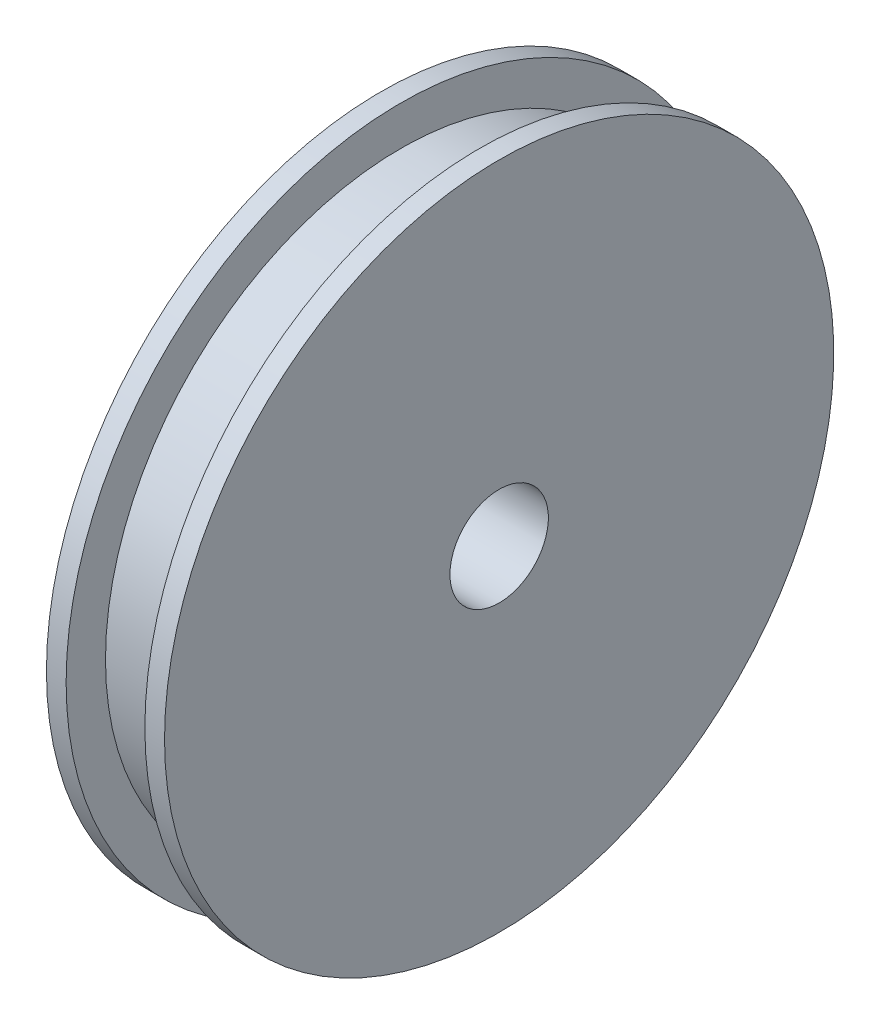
ISO-10303-21;
HEADER;
FILE_DESCRIPTION(('STEP AP214'),'2;1');
FILE_NAME('part.step','',(''),(''),'','','');
FILE_SCHEMA(('AUTOMOTIVE_DESIGN { 1 0 10303 214 1 1 1 1 }'));
ENDSEC;
DATA;
#1=APPLICATION_CONTEXT('core data for automotive mechanical design processes');
#2=APPLICATION_PROTOCOL_DEFINITION('international standard','automotive_design',2000,#1);
#3=PRODUCT_CONTEXT('',#1,'mechanical');
#4=PRODUCT('Part','Part','',(#3));
#5=PRODUCT_RELATED_PRODUCT_CATEGORY('part','',(#4));
#6=PRODUCT_DEFINITION_FORMATION('','',#4);
#7=PRODUCT_DEFINITION_CONTEXT('part definition',#1,'design');
#8=PRODUCT_DEFINITION('design','',#6,#7);
#9=PRODUCT_DEFINITION_SHAPE('','',#8);
#10=(LENGTH_UNIT() NAMED_UNIT(*) SI_UNIT(.MILLI.,.METRE.));
#11=(NAMED_UNIT(*) PLANE_ANGLE_UNIT() SI_UNIT($,.RADIAN.));
#12=(NAMED_UNIT(*) SI_UNIT($,.STERADIAN.) SOLID_ANGLE_UNIT());
#13=UNCERTAINTY_MEASURE_WITH_UNIT(LENGTH_MEASURE(1.E-05),#10,'distance_accuracy_value','');
#14=(GEOMETRIC_REPRESENTATION_CONTEXT(3) GLOBAL_UNCERTAINTY_ASSIGNED_CONTEXT((#13)) GLOBAL_UNIT_ASSIGNED_CONTEXT((#10,
#11,#12)) REPRESENTATION_CONTEXT('',''));
#15=CARTESIAN_POINT('',(0.,0.,0.));
#16=DIRECTION('',(0.,0.,1.));
#17=DIRECTION('',(1.,0.,0.));
#18=AXIS2_PLACEMENT_3D('',#15,#16,#17);
#19=CARTESIAN_POINT('',(3.,0.,0.));
#20=DIRECTION('',(-1.,0.,0.));
#21=DIRECTION('',(0.,0.,1.));
#22=AXIS2_PLACEMENT_3D('',#19,#20,#21);
#23=CYLINDRICAL_SURFACE('',#22,2.5);
#24=CARTESIAN_POINT('',(3.,0.,0.));
#25=DIRECTION('',(-1.,0.,0.));
#26=DIRECTION('',(0.,0.,1.));
#27=AXIS2_PLACEMENT_3D('',#24,#25,#26);
#28=CIRCLE('',#27,2.5);
#29=CARTESIAN_POINT('',(3.,0.,2.5));
#30=VERTEX_POINT('',#29);
#31=EDGE_CURVE('E67',#30,#30,#28,.T.);
#32=ORIENTED_EDGE('',*,*,#31,.F.);
#33=EDGE_LOOP('',(#32));
#34=FACE_BOUND('',#33,.T.);
#35=CARTESIAN_POINT('',(-2.,0.,0.));
#36=DIRECTION('',(-1.,0.,0.));
#37=DIRECTION('',(0.,0.,1.));
#38=AXIS2_PLACEMENT_3D('',#35,#36,#37);
#39=CIRCLE('',#38,2.5);
#40=CARTESIAN_POINT('',(-2.,0.,2.5));
#41=VERTEX_POINT('',#40);
#42=EDGE_CURVE('E10',#41,#41,#39,.F.);
#43=ORIENTED_EDGE('',*,*,#42,.F.);
#44=EDGE_LOOP('',(#43));
#45=FACE_BOUND('',#44,.T.);
#46=ADVANCED_FACE('F32',(#34,#45),#23,.F.);
#47=CARTESIAN_POINT('',(-3.,0.,0.));
#48=DIRECTION('',(1.,0.,0.));
#49=DIRECTION('',(0.,0.,-1.));
#50=AXIS2_PLACEMENT_3D('',#47,#48,#49);
#51=PLANE('',#50);
#52=CARTESIAN_POINT('',(-3.,0.,0.));
#53=DIRECTION('',(-1.,0.,0.));
#54=DIRECTION('',(0.,0.,1.));
#55=AXIS2_PLACEMENT_3D('',#52,#53,#54);
#56=CIRCLE('',#55,17.);
#57=CARTESIAN_POINT('',(-3.,0.,17.));
#58=VERTEX_POINT('',#57);
#59=EDGE_CURVE('E53',#58,#58,#56,.T.);
#60=ORIENTED_EDGE('',*,*,#59,.T.);
#61=EDGE_LOOP('',(#60));
#62=FACE_BOUND('',#61,.T.);
#63=CARTESIAN_POINT('',(-3.,0.,0.));
#64=DIRECTION('',(1.,0.,0.));
#65=DIRECTION('',(0.,0.,-1.));
#66=AXIS2_PLACEMENT_3D('',#63,#64,#65);
#67=CIRCLE('',#66,3.25);
#68=CARTESIAN_POINT('',(-3.,0.,-3.25));
#69=VERTEX_POINT('',#68);
#70=EDGE_CURVE('E39',#69,#69,#67,.F.);
#71=ORIENTED_EDGE('',*,*,#70,.F.);
#72=EDGE_LOOP('',(#71));
#73=FACE_BOUND('',#72,.T.);
#74=ADVANCED_FACE('F121',(#62,#73),#51,.F.);
#75=CARTESIAN_POINT('',(3.,0.,0.));
#76=DIRECTION('',(-1.,0.,0.));
#77=DIRECTION('',(0.,0.,1.));
#78=AXIS2_PLACEMENT_3D('',#75,#76,#77);
#79=CYLINDRICAL_SURFACE('',#78,15.);
#80=CARTESIAN_POINT('',(-2.,0.,0.));
#81=DIRECTION('',(-1.,0.,0.));
#82=DIRECTION('',(0.,0.,1.));
#83=AXIS2_PLACEMENT_3D('',#80,#81,#82);
#84=CIRCLE('',#83,15.);
#85=CARTESIAN_POINT('',(-2.,0.,15.));
#86=VERTEX_POINT('',#85);
#87=EDGE_CURVE('E47',#86,#86,#84,.T.);
#88=ORIENTED_EDGE('',*,*,#87,.F.);
#89=EDGE_LOOP('',(#88));
#90=FACE_BOUND('',#89,.T.);
#91=CARTESIAN_POINT('',(2.,0.,0.));
#92=DIRECTION('',(1.,0.,0.));
#93=DIRECTION('',(0.,0.,-1.));
#94=AXIS2_PLACEMENT_3D('',#91,#92,#93);
#95=CIRCLE('',#94,15.);
#96=CARTESIAN_POINT('',(2.,0.,-15.));
#97=VERTEX_POINT('',#96);
#98=EDGE_CURVE('E43',#97,#97,#95,.T.);
#99=ORIENTED_EDGE('',*,*,#98,.F.);
#100=EDGE_LOOP('',(#99));
#101=FACE_BOUND('',#100,.T.);
#102=ADVANCED_FACE('F34',(#90,#101),#79,.T.);
#103=CARTESIAN_POINT('',(-2.,0.,0.));
#104=DIRECTION('',(-1.,0.,0.));
#105=DIRECTION('',(0.,0.,1.));
#106=AXIS2_PLACEMENT_3D('',#103,#104,#105);
#107=PLANE('',#106);
#108=CARTESIAN_POINT('',(-2.,0.,0.));
#109=DIRECTION('',(-1.,0.,0.));
#110=DIRECTION('',(0.,0.,1.));
#111=AXIS2_PLACEMENT_3D('',#108,#109,#110);
#112=CIRCLE('',#111,17.);
#113=CARTESIAN_POINT('',(-2.,0.,17.));
#114=VERTEX_POINT('',#113);
#115=EDGE_CURVE('E52',#114,#114,#112,.T.);
#116=ORIENTED_EDGE('',*,*,#115,.F.);
#117=EDGE_LOOP('',(#116));
#118=FACE_BOUND('',#117,.T.);
#119=ORIENTED_EDGE('',*,*,#87,.T.);
#120=EDGE_LOOP('',(#119));
#121=FACE_BOUND('',#120,.T.);
#122=ADVANCED_FACE('F204',(#118,#121),#107,.F.);
#123=CARTESIAN_POINT('',(-2.,0.,0.));
#124=DIRECTION('',(-1.,0.,0.));
#125=DIRECTION('',(0.,0.,1.));
#126=AXIS2_PLACEMENT_3D('',#123,#124,#125);
#127=CYLINDRICAL_SURFACE('',#126,17.);
#128=ORIENTED_EDGE('',*,*,#115,.T.);
#129=EDGE_LOOP('',(#128));
#130=FACE_BOUND('',#129,.T.);
#131=ORIENTED_EDGE('',*,*,#59,.F.);
#132=EDGE_LOOP('',(#131));
#133=FACE_BOUND('',#132,.T.);
#134=ADVANCED_FACE('F195',(#130,#133),#127,.T.);
#135=CARTESIAN_POINT('',(2.,0.,0.));
#136=DIRECTION('',(1.,0.,0.));
#137=DIRECTION('',(0.,0.,1.));
#138=AXIS2_PLACEMENT_3D('',#135,#136,#137);
#139=PLANE('',#138);
#140=CARTESIAN_POINT('',(2.,0.,0.));
#141=DIRECTION('',(-1.,0.,0.));
#142=DIRECTION('',(0.,0.,1.));
#143=AXIS2_PLACEMENT_3D('',#140,#141,#142);
#144=CIRCLE('',#143,17.);
#145=CARTESIAN_POINT('',(2.,0.,17.));
#146=VERTEX_POINT('',#145);
#147=EDGE_CURVE('E56',#146,#146,#144,.T.);
#148=ORIENTED_EDGE('',*,*,#147,.T.);
#149=EDGE_LOOP('',(#148));
#150=FACE_BOUND('',#149,.T.);
#151=ORIENTED_EDGE('',*,*,#98,.T.);
#152=EDGE_LOOP('',(#151));
#153=FACE_BOUND('',#152,.T.);
#154=ADVANCED_FACE('F185',(#150,#153),#139,.F.);
#155=CARTESIAN_POINT('',(2.,0.,0.));
#156=DIRECTION('',(1.,0.,0.));
#157=DIRECTION('',(0.,0.,-1.));
#158=AXIS2_PLACEMENT_3D('',#155,#156,#157);
#159=CYLINDRICAL_SURFACE('',#158,17.);
#160=ORIENTED_EDGE('',*,*,#147,.F.);
#161=EDGE_LOOP('',(#160));
#162=FACE_BOUND('',#161,.T.);
#163=CARTESIAN_POINT('',(3.,0.,0.));
#164=DIRECTION('',(-1.,0.,0.));
#165=DIRECTION('',(0.,0.,1.));
#166=AXIS2_PLACEMENT_3D('',#163,#164,#165);
#167=CIRCLE('',#166,17.);
#168=CARTESIAN_POINT('',(3.,0.,17.));
#169=VERTEX_POINT('',#168);
#170=EDGE_CURVE('E59',#169,#169,#167,.T.);
#171=ORIENTED_EDGE('',*,*,#170,.T.);
#172=EDGE_LOOP('',(#171));
#173=FACE_BOUND('',#172,.T.);
#174=ADVANCED_FACE('F116',(#162,#173),#159,.T.);
#175=CARTESIAN_POINT('',(3.,0.,0.));
#176=DIRECTION('',(1.,0.,0.));
#177=DIRECTION('',(0.,0.,-1.));
#178=AXIS2_PLACEMENT_3D('',#175,#176,#177);
#179=PLANE('',#178);
#180=ORIENTED_EDGE('',*,*,#31,.T.);
#181=EDGE_LOOP('',(#180));
#182=FACE_BOUND('',#181,.T.);
#183=ORIENTED_EDGE('',*,*,#170,.F.);
#184=EDGE_LOOP('',(#183));
#185=FACE_BOUND('',#184,.T.);
#186=ADVANCED_FACE('F111',(#182,#185),#179,.T.);
#187=CARTESIAN_POINT('',(-6.,0.,0.));
#188=DIRECTION('',(1.,0.,0.));
#189=DIRECTION('',(0.,0.,-1.));
#190=AXIS2_PLACEMENT_3D('',#187,#188,#189);
#191=CYLINDRICAL_SURFACE('',#190,3.25);
#192=CARTESIAN_POINT('',(-6.,0.,0.));
#193=DIRECTION('',(-1.,0.,0.));
#194=DIRECTION('',(0.,0.,1.));
#195=AXIS2_PLACEMENT_3D('',#192,#193,#194);
#196=CIRCLE('',#195,3.25);
#197=CARTESIAN_POINT('',(-6.,0.,3.25));
#198=VERTEX_POINT('',#197);
#199=EDGE_CURVE('E62',#198,#198,#196,.T.);
#200=ORIENTED_EDGE('',*,*,#199,.F.);
#201=EDGE_LOOP('',(#200));
#202=FACE_BOUND('',#201,.T.);
#203=ORIENTED_EDGE('',*,*,#70,.T.);
#204=EDGE_LOOP('',(#203));
#205=FACE_BOUND('',#204,.T.);
#206=ADVANCED_FACE('F106',(#202,#205),#191,.T.);
#207=CARTESIAN_POINT('',(-6.,0.,0.));
#208=DIRECTION('',(-1.,0.,0.));
#209=DIRECTION('',(0.,0.,1.));
#210=AXIS2_PLACEMENT_3D('',#207,#208,#209);
#211=PLANE('',#210);
#212=CARTESIAN_POINT('',(-6.,0.,0.));
#213=DIRECTION('',(-1.,0.,0.));
#214=DIRECTION('',(0.,0.,1.));
#215=AXIS2_PLACEMENT_3D('',#212,#213,#214);
#216=CIRCLE('',#215,2.5);
#217=CARTESIAN_POINT('',(-6.,0.,2.5));
#218=VERTEX_POINT('',#217);
#219=EDGE_CURVE('E68',#218,#218,#216,.T.);
#220=ORIENTED_EDGE('',*,*,#219,.F.);
#221=EDGE_LOOP('',(#220));
#222=FACE_BOUND('',#221,.T.);
#223=ORIENTED_EDGE('',*,*,#199,.T.);
#224=EDGE_LOOP('',(#223));
#225=FACE_BOUND('',#224,.T.);
#226=ADVANCED_FACE('F100',(#222,#225),#211,.T.);
#227=CARTESIAN_POINT('',(-3.,0.,0.));
#228=DIRECTION('',(-1.,0.,0.));
#229=DIRECTION('',(0.,0.,1.));
#230=AXIS2_PLACEMENT_3D('',#227,#228,#229);
#231=CIRCLE('',#230,2.5);
#232=CARTESIAN_POINT('',(-3.,0.,2.5));
#233=VERTEX_POINT('',#232);
#234=EDGE_CURVE('E71',#233,#233,#231,.T.);
#235=ORIENTED_EDGE('',*,*,#234,.F.);
#236=EDGE_LOOP('',(#235));
#237=FACE_BOUND('',#236,.T.);
#238=ORIENTED_EDGE('',*,*,#219,.T.);
#239=EDGE_LOOP('',(#238));
#240=FACE_BOUND('',#239,.T.);
#241=ADVANCED_FACE('F97',(#237,#240),#23,.F.);
#242=CARTESIAN_POINT('',(-2.,0.,0.));
#243=DIRECTION('',(-1.,0.,0.));
#244=DIRECTION('',(0.,0.,1.));
#245=AXIS2_PLACEMENT_3D('',#242,#243,#244);
#246=PLANE('',#245);
#247=CARTESIAN_POINT('',(-2.,0.,0.));
#248=DIRECTION('',(-1.,0.,0.));
#249=DIRECTION('',(0.,0.,1.));
#250=AXIS2_PLACEMENT_3D('',#247,#248,#249);
#251=CIRCLE('',#250,1.75);
#252=CARTESIAN_POINT('',(-2.,0.,1.75));
#253=VERTEX_POINT('',#252);
#254=EDGE_CURVE('E76',#253,#253,#251,.T.);
#255=ORIENTED_EDGE('',*,*,#254,.T.);
#256=EDGE_LOOP('',(#255));
#257=FACE_BOUND('',#256,.T.);
#258=ORIENTED_EDGE('',*,*,#42,.T.);
#259=EDGE_LOOP('',(#258));
#260=FACE_BOUND('',#259,.T.);
#261=ADVANCED_FACE('F83',(#257,#260),#246,.F.);
#262=CARTESIAN_POINT('',(-3.,0.,0.));
#263=DIRECTION('',(-1.,0.,0.));
#264=DIRECTION('',(0.,0.,1.));
#265=AXIS2_PLACEMENT_3D('',#262,#263,#264);
#266=PLANE('',#265);
#267=CARTESIAN_POINT('',(-3.,0.,0.));
#268=DIRECTION('',(-1.,0.,0.));
#269=DIRECTION('',(0.,0.,1.));
#270=AXIS2_PLACEMENT_3D('',#267,#268,#269);
#271=CIRCLE('',#270,1.75);
#272=CARTESIAN_POINT('',(-3.,0.,1.75));
#273=VERTEX_POINT('',#272);
#274=EDGE_CURVE('E77',#273,#273,#271,.T.);
#275=ORIENTED_EDGE('',*,*,#274,.F.);
#276=EDGE_LOOP('',(#275));
#277=FACE_BOUND('',#276,.T.);
#278=ORIENTED_EDGE('',*,*,#234,.T.);
#279=EDGE_LOOP('',(#278));
#280=FACE_BOUND('',#279,.T.);
#281=ADVANCED_FACE('F88',(#277,#280),#266,.T.);
#282=CARTESIAN_POINT('',(-2.,0.,0.));
#283=DIRECTION('',(-1.,0.,0.));
#284=DIRECTION('',(0.,0.,1.));
#285=AXIS2_PLACEMENT_3D('',#282,#283,#284);
#286=CYLINDRICAL_SURFACE('',#285,1.75);
#287=ORIENTED_EDGE('',*,*,#254,.F.);
#288=EDGE_LOOP('',(#287));
#289=FACE_BOUND('',#288,.T.);
#290=ORIENTED_EDGE('',*,*,#274,.T.);
#291=EDGE_LOOP('',(#290));
#292=FACE_BOUND('',#291,.T.);
#293=ADVANCED_FACE('F85',(#289,#292),#286,.F.);
#294=CLOSED_SHELL('',(#46,#74,#102,#122,#134,#154,#174,#186,#206,#226,#241,#261,#281,#293));
#295=MANIFOLD_SOLID_BREP('B2',#294);
#296=ADVANCED_BREP_SHAPE_REPRESENTATION('',(#18,#295),#14);
#297=SHAPE_DEFINITION_REPRESENTATION(#9,#296);
ENDSEC;
END-ISO-10303-21;
